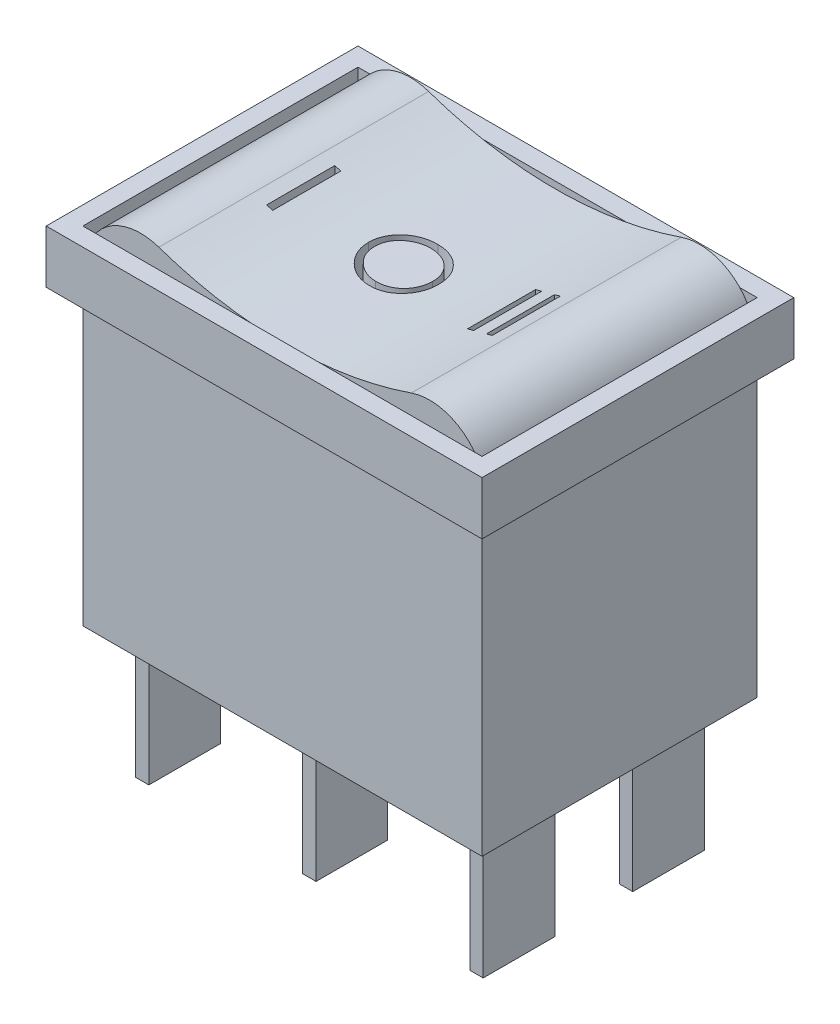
from build123d import *

# Parameters (mm, degrees)
SKETCH1_W                = 19.0881
SKETCH1_H                = 13.1572
BOSS_EXTRUDE1_DEPTH      = 15.2908
BOSS_EXTRUDE2_DEPTH      = 1.27
BOSS_EXTRUDE2_DEPTH_BACK = 1.27
SKETCH2_W                = 20.8407
SKETCH2_H                = 14.9098
SKETCH2_W_2              = 19.0881
SKETCH2_H_2              = 13.1572
BOSS_EXTRUDE3_DEPTH      = 6.4516
BOSS_EXTRUDE3_DEPTH_BACK = 6.4516
SKETCH4_W                = 0.635
SKETCH4_H                = 3.429
BOSS_EXTRUDE4_DEPTH      = 6.2992
SKETCH5_W                = 0.284935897
SKETCH5_H                = 3.256410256
SKETCH5_W_2              = 0.284935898
CUT_EXTRUDE1_DEPTH       = 25.022107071


with BuildPart() as part:
    # Sketch1 → Boss-Extrude1 (new body)
    with BuildSketch(Plane(origin=(0, 0, 0), x_dir=(1, 0, 0), z_dir=(0, 1, 0))):
        Rectangle(SKETCH1_W, SKETCH1_H)
    extrude(amount=BOSS_EXTRUDE1_DEPTH)

    # Sketch2 → Boss-Extrude2 (add, two sides: drawn at the far end of the back side and taken through both)
    with BuildSketch(Plane(origin=(0, 15.2908, 0), x_dir=(1, 0, 0), z_dir=(0, 1, 0)).offset(-BOSS_EXTRUDE2_DEPTH_BACK)):
        Rectangle(SKETCH2_W, SKETCH2_H)
        Rectangle(SKETCH2_W_2, SKETCH2_H_2, mode=Mode.SUBTRACT)
    extrude(amount=BOSS_EXTRUDE2_DEPTH + BOSS_EXTRUDE2_DEPTH_BACK)

    # Sketch3 → Boss-Extrude3 (add, two sides: drawn at the far end of the back side and taken through both)
    with BuildSketch(Plane.XY.offset(-BOSS_EXTRUDE3_DEPTH_BACK)):
        with BuildLine():
            Line((-9.54405, 15.2908), (9.54405, 15.2908))
            ThreePointArc((9.54405, 15.2908), (8.272952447, 17.143566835), (6.037727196, 17.372044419))
            ThreePointArc((6.037727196, 17.372044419), (0, 16.360624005), (-6.037727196, 17.372044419))
            ThreePointArc((-6.037727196, 17.372044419), (-8.272952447, 17.143566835), (-9.54405, 15.2908))
        make_face()
    extrude(amount=BOSS_EXTRUDE3_DEPTH + BOSS_EXTRUDE3_DEPTH_BACK)

    # Sketch4 → Boss-Extrude4 (add)
    with BuildSketch(Plane.XZ):
        with Locations((-7.99403481, 3.575642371)):
            Rectangle(SKETCH4_W, SKETCH4_H)
        with Locations((0, 3.575642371)):
            Rectangle(SKETCH4_W, SKETCH4_H)
        with Locations((7.99403481, 3.575642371)):
            Rectangle(SKETCH4_W, SKETCH4_H)
        with Locations((-7.99403481, -3.575642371)):
            Rectangle(SKETCH4_W, SKETCH4_H)
        with Locations((0, -3.575642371)):
            Rectangle(SKETCH4_W, SKETCH4_H)
        with Locations((7.99403481, -3.575642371)):
            Rectangle(SKETCH4_W, SKETCH4_H)
    extrude(amount=BOSS_EXTRUDE4_DEPTH)

    # Sketch5 → Cut-Extrude1 (cut, through all)
    # profile 1 of 4: a face of its own
    with BuildSketch(Plane(origin=(0, 14.0208, 0), x_dir=(1, 0, 0), z_dir=(0, 1, 0))):
        with Locations((-5.271314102, -0.28798662)):
            Rectangle(SKETCH5_W, SKETCH5_H)
    # profile 2 of 4: a face of its own
    with BuildSketch(Plane(origin=(0, 14.0208, 0), x_dir=(1, 0, 0), z_dir=(0, 1, 0))):
        with BuildLine():
            add(Edge.make_bspline(
                [(-0.468108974, 1.340218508), (-0.409318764, 1.338729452), (-0.29384994, 1.335804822), (-0.124146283, 1.31341735), (0.037864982, 1.274686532), (0.193503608, 1.223103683), (0.340907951, 1.154292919), (0.481187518, 1.071121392), (0.614008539, 0.972717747), (0.737580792, 0.859842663), (0.850662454, 0.73703053), (0.950290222, 0.605968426), (1.033785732, 0.467448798), (1.102352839, 0.321887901), (1.156145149, 0.16961493), (1.193264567, 0.009818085), (1.216975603, -0.156467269), (1.21974763, -0.269884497), (1.221153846, -0.327419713)],
                knots=[0, 0, 0, 0, 1.065120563, 2.091984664, 3.0946048, 4.079830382, 5.057816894, 6.036188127, 7.030412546, 8.04752943, 9.064399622, 10.05169764, 11.02544977, 11.989514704, 12.962713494, 13.945757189, 14.957906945, 16, 16, 16, 16], degree=3))
            add(Edge.make_bspline(
                [(1.221153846, -0.327419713), (1.219747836, -0.384531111), (1.216976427, -0.497104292), (1.193237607, -0.662334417), (1.156007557, -0.821166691), (1.102852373, -0.973335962), (1.034612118, -1.119002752), (0.950560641, -1.257783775), (0.851553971, -1.389724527), (0.738880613, -1.513379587), (0.616052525, -1.62677015), (0.484307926, -1.72557513), (0.3466097, -1.8105963), (0.201185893, -1.878435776), (0.049965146, -1.932657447), (-0.108405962, -1.969625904), (-0.273185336, -1.993472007), (-0.385554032, -1.996210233), (-0.442668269, -1.997602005)],
                knots=[0, 0, 0, 0, 1.043624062, 2.057103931, 3.04512605, 4.022047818, 4.998200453, 5.980619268, 6.982898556, 8.009068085, 9.034988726, 10.034168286, 11.015286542, 11.987931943, 12.962482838, 13.94673481, 14.956375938, 16, 16, 16, 16], degree=3))
            add(Edge.make_bspline(
                [(-0.442668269, -1.997602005), (-0.500203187, -1.99619649), (-0.613619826, -1.993425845), (-0.780114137, -1.969675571), (-0.940023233, -1.932535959), (-1.092889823, -1.879459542), (-1.238799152, -1.810863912), (-1.378036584, -1.727221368), (-1.510043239, -1.627973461), (-1.63372468, -1.51533664), (-1.746890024, -1.392716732), (-1.845550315, -1.261331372), (-1.929211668, -1.123758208), (-1.997576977, -0.979615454), (-2.051701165, -0.829599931), (-2.08862625, -0.672710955), (-2.112516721, -0.509842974), (-2.11526976, -0.398951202), (-2.116666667, -0.342684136)],
                knots=[0, 0, 0, 0, 1.053102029, 2.075944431, 3.073151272, 4.055350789, 5.033113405, 6.020478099, 7.024410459, 8.052272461, 9.079885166, 10.07527673, 11.055994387, 12.023226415, 12.992069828, 13.970394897, 14.97016774, 16, 16, 16, 16], degree=3))
            add(Edge.make_bspline(
                [(-2.116666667, -0.342684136), (-2.116181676, -0.304917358), (-2.115217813, -0.229860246), (-2.10361392, -0.118402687), (-2.086775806, -0.00873759), (-2.062644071, 0.098823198), (-2.031083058, 0.204016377), (-1.993843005, 0.307567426), (-1.948359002, 0.408426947), (-1.896941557, 0.507072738), (-1.83955406, 0.601967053), (-1.776166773, 0.69166496), (-1.709006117, 0.77691915), (-1.635379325, 0.855520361), (-1.557712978, 0.929755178), (-1.474747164, 0.998482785), (-1.386988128, 1.062322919), (-1.294058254, 1.119854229), (-1.198247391, 1.171887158), (-1.0994806, 1.216538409), (-0.999099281, 1.254861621), (-0.896633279, 1.285922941), (-0.792354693, 1.31044486), (-0.686035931, 1.327142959), (-0.577761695, 1.338776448), (-0.504817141, 1.339735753), (-0.468108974, 1.340218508)],
                knots=[0, 0, 0, 0, 1.037015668, 2.060948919, 3.074880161, 4.083647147, 5.086022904, 6.090072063, 7.104153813, 8.122640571, 9.144368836, 10.147691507, 11.138137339, 12.123020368, 13.103399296, 14.087645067, 15.080126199, 16.082011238, 17.087798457, 18.072939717, 19.057185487, 20.037253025, 21.01195951, 21.997135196, 22.992090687, 24, 24, 24, 24], degree=3))
        make_face()
        with BuildLine():
            add(Edge.make_bspline(
                [(-0.454116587, 1.014577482), (-0.484247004, 1.014210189), (-0.54421979, 1.013479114), (-0.633377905, 1.003849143), (-0.721363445, 0.990124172), (-0.808194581, 0.97054665), (-0.893508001, 0.943872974), (-0.978098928, 0.913174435), (-1.061195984, 0.875781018), (-1.142524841, 0.833532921), (-1.22136923, 0.786770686), (-1.295766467, 0.735089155), (-1.365909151, 0.679700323), (-1.431625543, 0.620474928), (-1.492722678, 0.557111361), (-1.550403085, 0.490570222), (-1.602354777, 0.418949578), (-1.649966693, 0.344191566), (-1.692573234, 0.26639356), (-1.730460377, 0.186374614), (-1.761452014, 0.103481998), (-1.78672717, 0.018615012), (-1.807681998, -0.068091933), (-1.820957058, -0.157296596), (-1.830692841, -0.248550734), (-1.831382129, -0.310219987), (-1.831730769, -0.341412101)],
                knots=[0, 0, 0, 0, 1.008559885, 2.007477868, 2.99961109, 3.989939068, 4.984837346, 5.991145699, 7.001802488, 8.033829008, 9.059044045, 10.069351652, 11.065060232, 12.050310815, 13.029377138, 14.011219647, 14.996725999, 15.989392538, 16.977580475, 17.965360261, 18.951710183, 19.937753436, 20.929683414, 21.935841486, 22.955955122, 24, 24, 24, 24], degree=3))
            add(Edge.make_bspline(
                [(-1.831730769, -0.341412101), (-1.830574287, -0.387279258), (-1.82829913, -0.477514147), (-1.808380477, -0.609746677), (-1.777699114, -0.736826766), (-1.73247136, -0.858059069), (-1.675910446, -0.974485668), (-1.606036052, -1.085073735), (-1.523251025, -1.189853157), (-1.429213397, -1.288092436), (-1.326413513, -1.377759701), (-1.217254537, -1.456466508), (-1.102905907, -1.523060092), (-0.98306943, -1.577311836), (-0.858384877, -1.620301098), (-0.728048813, -1.649763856), (-0.592929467, -1.669154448), (-0.500826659, -1.671016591), (-0.454116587, -1.671960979)],
                knots=[0, 0, 0, 0, 1.032063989, 2.030389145, 3.003944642, 3.970395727, 4.937377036, 5.913328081, 6.909231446, 7.93887556, 8.970685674, 9.976071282, 10.964166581, 11.944589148, 12.933237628, 13.927779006, 14.949070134, 16, 16, 16, 16], degree=3))
            add(Edge.make_bspline(
                [(-0.454116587, -1.671960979), (-0.422720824, -1.671529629), (-0.360453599, -1.670674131), (-0.267838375, -1.662057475), (-0.176891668, -1.648239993), (-0.087741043, -1.628345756), (-0.000487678, -1.603447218), (0.085232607, -1.573867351), (0.168506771, -1.536963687), (0.250385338, -1.496189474), (0.328759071, -1.449707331), (0.403576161, -1.399779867), (0.4729508, -1.344472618), (0.538618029, -1.286127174), (0.599966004, -1.223567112), (0.656579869, -1.156873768), (0.708268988, -1.085626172), (0.755862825, -1.010981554), (0.798320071, -0.932970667), (0.835312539, -0.852661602), (0.866696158, -0.77025211), (0.892031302, -0.685623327), (0.911884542, -0.598935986), (0.925564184, -0.510074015), (0.935133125, -0.419215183), (0.935854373, -0.357761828), (0.936217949, -0.326783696)],
                knots=[0, 0, 0, 0, 1.047197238, 2.076906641, 3.100256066, 4.114471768, 5.12198147, 6.126382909, 7.136867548, 8.15857795, 9.17633901, 10.174870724, 11.156907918, 12.133735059, 13.104061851, 14.077631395, 15.04955518, 16.038496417, 17.029181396, 18.010275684, 18.986308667, 19.968651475, 20.955262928, 21.950658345, 22.966943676, 24, 24, 24, 24], degree=3))
            add(Edge.make_bspline(
                [(0.936217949, -0.326783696), (0.935854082, -0.296017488), (0.935132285, -0.234987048), (0.925568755, -0.144761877), (0.91187009, -0.056539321), (0.892128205, 0.029334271), (0.866682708, 0.112880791), (0.835307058, 0.194021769), (0.798308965, 0.273059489), (0.755847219, 0.349798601), (0.70811715, 0.423435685), (0.655961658, 0.493832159), (0.598480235, 0.559666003), (0.537315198, 0.622562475), (0.470938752, 0.681180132), (0.399651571, 0.735538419), (0.324319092, 0.786949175), (0.244556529, 0.833327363), (0.162238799, 0.876157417), (0.077771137, 0.912852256), (-0.007889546, 0.944032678), (-0.094525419, 0.970627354), (-0.182865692, 0.990047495), (-0.272313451, 1.003861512), (-0.362744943, 1.013475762), (-0.423562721, 1.014209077), (-0.454116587, 1.014577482)],
                knots=[0, 0, 0, 0, 1.02996197, 2.043119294, 3.035359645, 4.018872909, 4.991431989, 5.957985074, 6.929999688, 7.912076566, 8.892894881, 9.867085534, 10.843653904, 11.817741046, 12.803660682, 13.806313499, 14.818574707, 15.856120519, 16.894564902, 17.924820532, 18.937903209, 19.946497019, 20.957711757, 21.963978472, 22.977135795, 24, 24, 24, 24], degree=3))
        make_face(mode=Mode.SUBTRACT)
    # profile 3 of 4: a face of its own
    with BuildSketch(Plane(origin=(0, 14.0208, 0), x_dir=(1, 0, 0), z_dir=(0, 1, 0))):
        with Locations((4.335096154, -0.28798662)):
            Rectangle(SKETCH5_W_2, SKETCH5_H)
    # profile 4 of 4: a face of its own
    with BuildSketch(Plane(origin=(0, 14.0208, 0), x_dir=(1, 0, 0), z_dir=(0, 1, 0))):
        with Locations((5.230608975, -0.28798662)):
            Rectangle(SKETCH5_W, SKETCH5_H)
    extrude(amount=CUT_EXTRUDE1_DEPTH, mode=Mode.SUBTRACT)


solid = part.part
